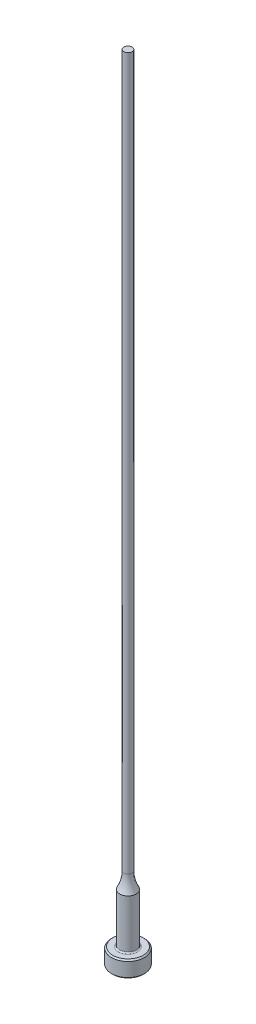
from build123d import *

# Parameters (mm, degrees)
CHAMFER1_SIZE = 0.254
FILLET1_R     = 0.254


with BuildPart() as part:
    # Sketch1 → Revolve1 (revolve)
    with BuildSketch(Plane.XY, mode=Mode.PRIVATE) as revolve1_sk:
        with BuildLine():
            Line((0, 0), (-3.175, 0))
            Line((-3.175, 0), (-3.175, 3.175))
            Line((-3.175, 3.175), (-1.5875, 3.175))
            Line((-1.5875, 3.175), (-1.5875, 12.7))
            ThreePointArc((-1.5875, 12.7), (-0.995388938, 14.186680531), (-0.79375, 15.774180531))
            Line((-0.79375, 15.774180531), (-0.79375, 152.4))
            Line((-0.79375, 152.4), (0, 152.4))
            Line((0, 152.4), (0, 0))
        make_face()
    revolve(revolve1_sk.sketch.rotate(Axis((0, 259.958771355, 0), (0, -1, 0)), 270), axis=Axis((0, 259.958771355, 0), (0, -1, 0)))

    # Chamfer1
    chamfer1_edges = [part.edges().sort_by_distance(p)[0] for p in [
        (0, 0, -3.175),
        (0, 3.175, -3.175),
    ]]
    chamfer(chamfer1_edges, length=CHAMFER1_SIZE)

    # Fillet1
    fillet1_edges = [part.edges().sort_by_distance(p)[0] for p in [
        (0, 3.175, -1.5875),
    ]]
    fillet(fillet1_edges, radius=FILLET1_R)


solid = part.part
